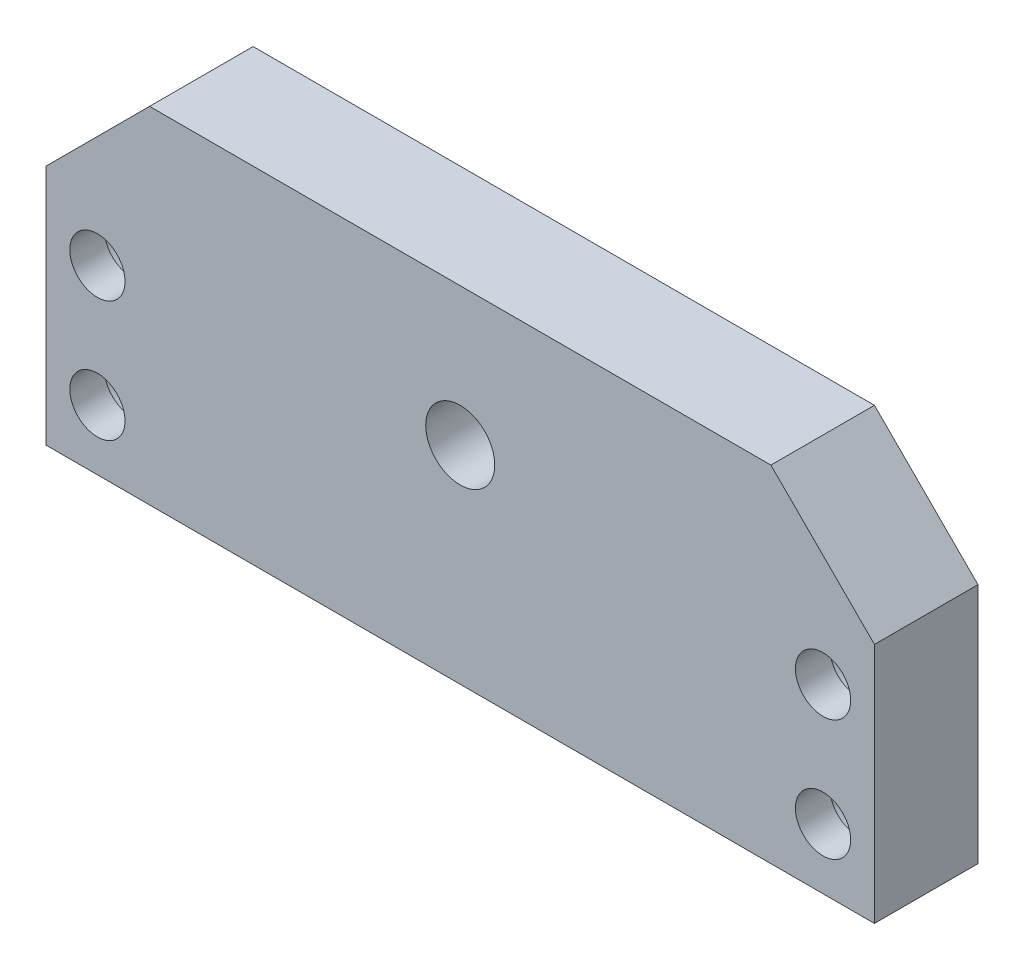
from build123d import *

# Parameters (mm, degrees)
SKETCH1_W           = 120
SKETCH1_H           = 50
BOSS_EXTRUDE1_DEPTH = 15
CHAMFER1_SIZE       = 15
SKETCH2_R           = 6.25
CUT_EXTRUDE1_DEPTH  = 10
SKETCH3_R           = 4
CUT_EXTRUDE2_DEPTH  = 10
SKETCH4_R           = 5
CUT_EXTRUDE3_DEPTH  = 50


with BuildPart() as part:
    # Sketch1 → Boss-Extrude1 (new body)
    with BuildSketch(Plane.XY):
        Rectangle(SKETCH1_W, SKETCH1_H)
    extrude(amount=BOSS_EXTRUDE1_DEPTH)

    # Chamfer1
    chamfer1_edges = [part.edges().sort_by_distance(p)[0] for p in [
        (-60, 25, 7.5),
        (60, 25, 7.5),
    ]]
    chamfer(chamfer1_edges, length=CHAMFER1_SIZE)

    # Sketch2 → Cut-Extrude1 (cut)
    with BuildSketch(Plane(origin=(0, 0, 0), x_dir=(-1, 0, 0), z_dir=(0, 0, -1))):
        with Locations((-52.553527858, 1.25)):
            Circle(SKETCH2_R)
        with Locations((-52.553527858, -16.25)):
            Circle(SKETCH2_R)
        with Locations((52.553527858, 1.25)):
            Circle(SKETCH2_R)
        with Locations((52.553527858, -16.25)):
            Circle(SKETCH2_R)
    extrude(amount=-CUT_EXTRUDE1_DEPTH, mode=Mode.SUBTRACT)

    # Sketch3 → Cut-Extrude2 (cut)
    with BuildSketch(Plane(origin=(0, 0, 10), x_dir=(-1, 0, 0), z_dir=(0, 0, -1))):
        with Locations((-52.553527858, 1.25)):
            Circle(SKETCH3_R)
        with Locations((-52.553527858, -16.25)):
            Circle(SKETCH3_R)
        with Locations((52.553527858, -16.25)):
            Circle(SKETCH3_R)
        with Locations((52.553527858, 1.25)):
            Circle(SKETCH3_R)
    extrude(amount=-CUT_EXTRUDE2_DEPTH, mode=Mode.SUBTRACT)

    # Sketch4 → Cut-Extrude3 (cut)
    with BuildSketch(Plane(origin=(0, 0, 0), x_dir=(-1, 0, 0), z_dir=(0, 0, -1))):
        with Locations((0, 5)):
            Circle(SKETCH4_R)
    extrude(amount=-CUT_EXTRUDE3_DEPTH, mode=Mode.SUBTRACT)


solid = part.part
